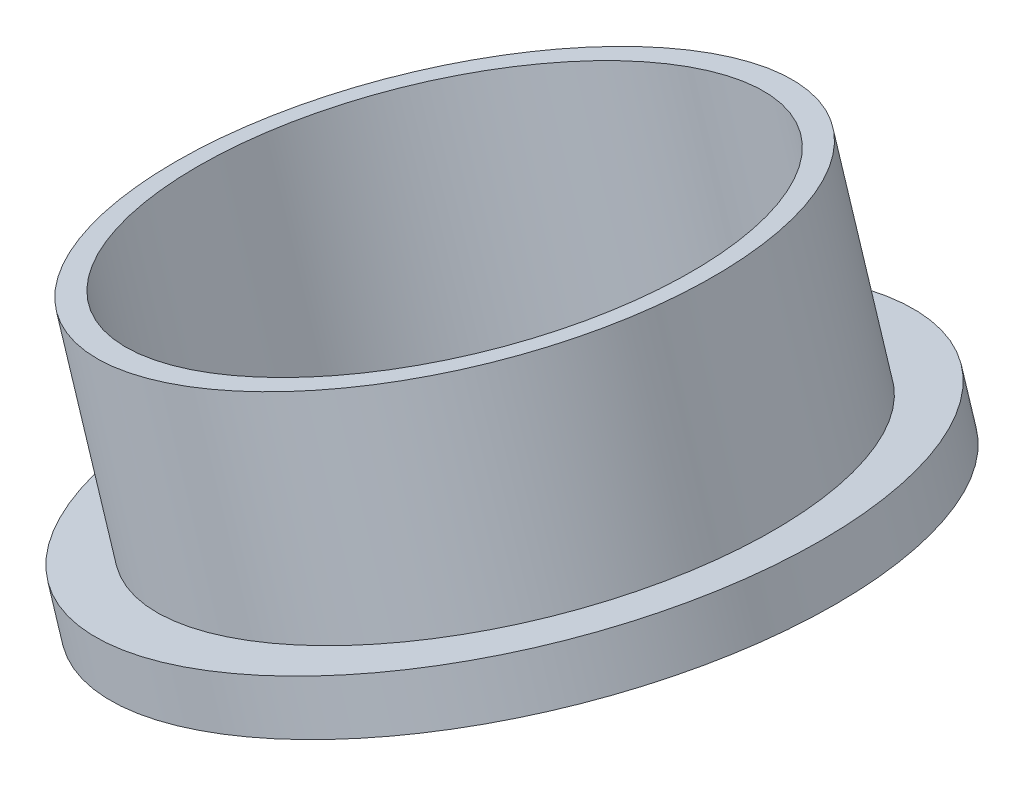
ISO-10303-21;
HEADER;
FILE_DESCRIPTION(('STEP AP214'),'2;1');
FILE_NAME('part.step','',(''),(''),'','','');
FILE_SCHEMA(('AUTOMOTIVE_DESIGN { 1 0 10303 214 1 1 1 1 }'));
ENDSEC;
DATA;
#1=APPLICATION_CONTEXT('core data for automotive mechanical design processes');
#2=APPLICATION_PROTOCOL_DEFINITION('international standard','automotive_design',2000,#1);
#3=PRODUCT_CONTEXT('',#1,'mechanical');
#4=PRODUCT('Part','Part','',(#3));
#5=PRODUCT_RELATED_PRODUCT_CATEGORY('part','',(#4));
#6=PRODUCT_DEFINITION_FORMATION('','',#4);
#7=PRODUCT_DEFINITION_CONTEXT('part definition',#1,'design');
#8=PRODUCT_DEFINITION('design','',#6,#7);
#9=PRODUCT_DEFINITION_SHAPE('','',#8);
#10=(LENGTH_UNIT() NAMED_UNIT(*) SI_UNIT(.MILLI.,.METRE.));
#11=(NAMED_UNIT(*) PLANE_ANGLE_UNIT() SI_UNIT($,.RADIAN.));
#12=(NAMED_UNIT(*) SI_UNIT($,.STERADIAN.) SOLID_ANGLE_UNIT());
#13=UNCERTAINTY_MEASURE_WITH_UNIT(LENGTH_MEASURE(1.E-05),#10,'distance_accuracy_value','');
#14=(GEOMETRIC_REPRESENTATION_CONTEXT(3) GLOBAL_UNCERTAINTY_ASSIGNED_CONTEXT((#13)) GLOBAL_UNIT_ASSIGNED_CONTEXT((#10,
#11,#12)) REPRESENTATION_CONTEXT('',''));
#15=CARTESIAN_POINT('',(0.,0.,0.));
#16=DIRECTION('',(0.,0.,1.));
#17=DIRECTION('',(1.,0.,0.));
#18=AXIS2_PLACEMENT_3D('',#15,#16,#17);
#19=CARTESIAN_POINT('',(404.28785676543,409.593144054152,0.));
#20=DIRECTION('',(-0.300714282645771,0.953714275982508,0.));
#21=DIRECTION('',(-0.953714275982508,-0.300714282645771,0.));
#22=AXIS2_PLACEMENT_3D('',#19,#20,#21);
#23=CYLINDRICAL_SURFACE('',#22,15.6);
#24=CARTESIAN_POINT('',(410.302142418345,390.518858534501,0.));
#25=DIRECTION('',(-0.300714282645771,0.953714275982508,0.));
#26=DIRECTION('',(-0.953714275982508,-0.300714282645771,0.));
#27=AXIS2_PLACEMENT_3D('',#24,#25,#26);
#28=CIRCLE('',#27,15.6);
#29=CARTESIAN_POINT('',(395.424199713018,385.827715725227,0.));
#30=VERTEX_POINT('',#29);
#31=EDGE_CURVE('E54',#30,#30,#28,.T.);
#32=ORIENTED_EDGE('',*,*,#31,.F.);
#33=EDGE_LOOP('',(#32));
#34=FACE_BOUND('',#33,.T.);
#35=CARTESIAN_POINT('',(405.791428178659,404.824572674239,0.));
#36=DIRECTION('',(-0.300714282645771,0.953714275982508,0.));
#37=DIRECTION('',(-0.953714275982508,-0.300714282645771,0.));
#38=AXIS2_PLACEMENT_3D('',#35,#36,#37);
#39=CIRCLE('',#38,15.5999999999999);
#40=CARTESIAN_POINT('',(390.913485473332,400.133429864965,0.));
#41=VERTEX_POINT('',#40);
#42=EDGE_CURVE('E10',#41,#41,#39,.T.);
#43=ORIENTED_EDGE('',*,*,#42,.T.);
#44=EDGE_LOOP('',(#43));
#45=FACE_BOUND('',#44,.T.);
#46=ADVANCED_FACE('F32',(#34,#45),#23,.F.);
#47=CARTESIAN_POINT('',(420.669370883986,409.515715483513,0.));
#48=DIRECTION('',(0.300714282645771,-0.953714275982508,0.));
#49=DIRECTION('',(0.953714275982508,0.300714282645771,0.));
#50=AXIS2_PLACEMENT_3D('',#47,#48,#49);
#51=PLANE('',#50);
#52=ORIENTED_EDGE('',*,*,#42,.F.);
#53=EDGE_LOOP('',(#52));
#54=FACE_BOUND('',#53,.T.);
#55=CARTESIAN_POINT('',(405.791428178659,404.824572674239,0.));
#56=DIRECTION('',(-0.300714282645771,0.953714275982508,0.));
#57=DIRECTION('',(-0.953714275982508,-0.300714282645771,0.));
#58=AXIS2_PLACEMENT_3D('',#55,#56,#57);
#59=CIRCLE('',#58,16.9999999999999);
#60=CARTESIAN_POINT('',(389.578285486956,399.712429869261,0.));
#61=VERTEX_POINT('',#60);
#62=EDGE_CURVE('E38',#61,#61,#59,.T.);
#63=ORIENTED_EDGE('',*,*,#62,.T.);
#64=EDGE_LOOP('',(#63));
#65=FACE_BOUND('',#64,.T.);
#66=ADVANCED_FACE('F61',(#54,#65),#51,.F.);
#67=CARTESIAN_POINT('',(404.28785676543,409.593144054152,0.));
#68=DIRECTION('',(-0.300714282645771,0.953714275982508,0.));
#69=DIRECTION('',(-0.953714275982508,-0.300714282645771,0.));
#70=AXIS2_PLACEMENT_3D('',#67,#68,#69);
#71=CYLINDRICAL_SURFACE('',#70,17.);
#72=ORIENTED_EDGE('',*,*,#62,.F.);
#73=EDGE_LOOP('',(#72));
#74=FACE_BOUND('',#73,.T.);
#75=CARTESIAN_POINT('',(409.399999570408,393.380001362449,0.));
#76=DIRECTION('',(-0.300714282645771,0.953714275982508,0.));
#77=DIRECTION('',(-0.953714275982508,-0.300714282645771,0.));
#78=AXIS2_PLACEMENT_3D('',#75,#76,#77);
#79=CIRCLE('',#78,17.);
#80=CARTESIAN_POINT('',(393.186856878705,388.267858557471,0.));
#81=VERTEX_POINT('',#80);
#82=EDGE_CURVE('E42',#81,#81,#79,.T.);
#83=ORIENTED_EDGE('',*,*,#82,.T.);
#84=EDGE_LOOP('',(#83));
#85=FACE_BOUND('',#84,.T.);
#86=ADVANCED_FACE('F65',(#74,#85),#71,.T.);
#87=CARTESIAN_POINT('',(425.613142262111,398.492144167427,0.));
#88=DIRECTION('',(0.300714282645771,-0.953714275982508,0.));
#89=DIRECTION('',(0.953714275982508,0.300714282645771,0.));
#90=AXIS2_PLACEMENT_3D('',#87,#88,#89);
#91=PLANE('',#90);
#92=ORIENTED_EDGE('',*,*,#82,.F.);
#93=EDGE_LOOP('',(#92));
#94=FACE_BOUND('',#93,.T.);
#95=CARTESIAN_POINT('',(409.399999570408,393.380001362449,0.));
#96=DIRECTION('',(-0.300714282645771,0.953714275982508,0.));
#97=DIRECTION('',(-0.953714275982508,-0.300714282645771,0.));
#98=AXIS2_PLACEMENT_3D('',#95,#96,#97);
#99=CIRCLE('',#98,20.0000000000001);
#100=CARTESIAN_POINT('',(390.325714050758,387.365715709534,0.));
#101=VERTEX_POINT('',#100);
#102=EDGE_CURVE('E46',#101,#101,#99,.T.);
#103=ORIENTED_EDGE('',*,*,#102,.T.);
#104=EDGE_LOOP('',(#103));
#105=FACE_BOUND('',#104,.T.);
#106=ADVANCED_FACE('F70',(#94,#105),#91,.F.);
#107=CARTESIAN_POINT('',(404.28785676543,409.593144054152,0.));
#108=DIRECTION('',(-0.300714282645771,0.953714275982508,0.));
#109=DIRECTION('',(-0.953714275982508,-0.300714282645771,0.));
#110=AXIS2_PLACEMENT_3D('',#107,#108,#109);
#111=CYLINDRICAL_SURFACE('',#110,20.0000000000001);
#112=ORIENTED_EDGE('',*,*,#102,.F.);
#113=EDGE_LOOP('',(#112));
#114=FACE_BOUND('',#113,.T.);
#115=CARTESIAN_POINT('',(410.302142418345,390.518858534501,0.));
#116=DIRECTION('',(-0.300714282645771,0.953714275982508,0.));
#117=DIRECTION('',(-0.953714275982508,-0.300714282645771,0.));
#118=AXIS2_PLACEMENT_3D('',#115,#116,#117);
#119=CIRCLE('',#118,20.);
#120=CARTESIAN_POINT('',(391.227856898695,384.504572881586,0.));
#121=VERTEX_POINT('',#120);
#122=EDGE_CURVE('E51',#121,#121,#119,.T.);
#123=ORIENTED_EDGE('',*,*,#122,.T.);
#124=EDGE_LOOP('',(#123));
#125=FACE_BOUND('',#124,.T.);
#126=ADVANCED_FACE('F76',(#114,#125),#111,.T.);
#127=CARTESIAN_POINT('',(429.376427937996,396.533144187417,0.));
#128=DIRECTION('',(-0.300714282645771,0.953714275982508,0.));
#129=DIRECTION('',(-0.953714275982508,-0.300714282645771,0.));
#130=AXIS2_PLACEMENT_3D('',#127,#128,#129);
#131=PLANE('',#130);
#132=ORIENTED_EDGE('',*,*,#122,.F.);
#133=EDGE_LOOP('',(#132));
#134=FACE_BOUND('',#133,.T.);
#135=ORIENTED_EDGE('',*,*,#31,.T.);
#136=EDGE_LOOP('',(#135));
#137=FACE_BOUND('',#136,.T.);
#138=ADVANCED_FACE('F58',(#134,#137),#131,.F.);
#139=CLOSED_SHELL('',(#46,#66,#86,#106,#126,#138));
#140=MANIFOLD_SOLID_BREP('B2',#139);
#141=ADVANCED_BREP_SHAPE_REPRESENTATION('',(#18,#140),#14);
#142=SHAPE_DEFINITION_REPRESENTATION(#9,#141);
ENDSEC;
END-ISO-10303-21;
